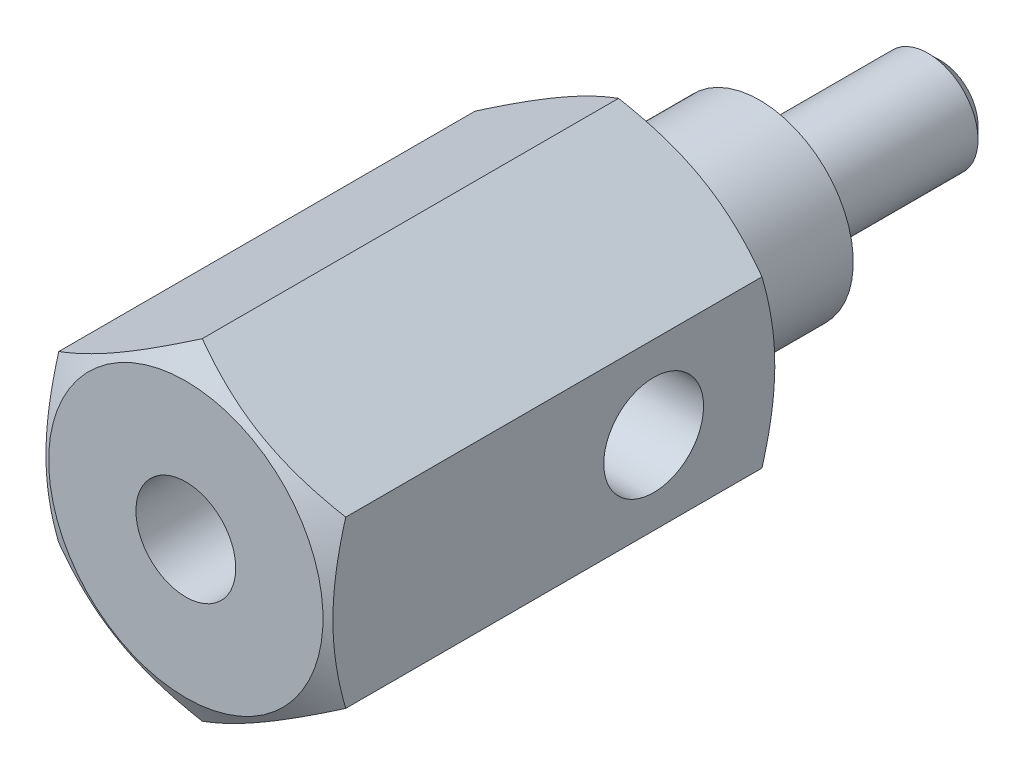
ISO-10303-21;
HEADER;
FILE_DESCRIPTION(('STEP AP214'),'2;1');
FILE_NAME('part.step','',(''),(''),'','','');
FILE_SCHEMA(('AUTOMOTIVE_DESIGN { 1 0 10303 214 1 1 1 1 }'));
ENDSEC;
DATA;
#1=APPLICATION_CONTEXT('core data for automotive mechanical design processes');
#2=APPLICATION_PROTOCOL_DEFINITION('international standard','automotive_design',2000,#1);
#3=PRODUCT_CONTEXT('',#1,'mechanical');
#4=PRODUCT('Part','Part','',(#3));
#5=PRODUCT_RELATED_PRODUCT_CATEGORY('part','',(#4));
#6=PRODUCT_DEFINITION_FORMATION('','',#4);
#7=PRODUCT_DEFINITION_CONTEXT('part definition',#1,'design');
#8=PRODUCT_DEFINITION('design','',#6,#7);
#9=PRODUCT_DEFINITION_SHAPE('','',#8);
#10=(LENGTH_UNIT() NAMED_UNIT(*) SI_UNIT(.MILLI.,.METRE.));
#11=(NAMED_UNIT(*) PLANE_ANGLE_UNIT() SI_UNIT($,.RADIAN.));
#12=(NAMED_UNIT(*) SI_UNIT($,.STERADIAN.) SOLID_ANGLE_UNIT());
#13=UNCERTAINTY_MEASURE_WITH_UNIT(LENGTH_MEASURE(1.E-05),#10,'distance_accuracy_value','');
#14=(GEOMETRIC_REPRESENTATION_CONTEXT(3) GLOBAL_UNCERTAINTY_ASSIGNED_CONTEXT((#13)) GLOBAL_UNIT_ASSIGNED_CONTEXT((#10,
#11,#12)) REPRESENTATION_CONTEXT('',''));
#15=CARTESIAN_POINT('',(0.,0.,0.));
#16=DIRECTION('',(0.,0.,1.));
#17=DIRECTION('',(1.,0.,0.));
#18=AXIS2_PLACEMENT_3D('',#15,#16,#17);
#19=CARTESIAN_POINT('',(13.5,0.,18.0000000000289));
#20=DIRECTION('',(0.,0.,-1.));
#21=DIRECTION('',(0.,1.,0.));
#22=AXIS2_PLACEMENT_3D('',#19,#20,#21);
#23=PLANE('',#22);
#24=CARTESIAN_POINT('',(0.,0.,18.0000000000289));
#25=DIRECTION('',(0.,0.,1.));
#26=DIRECTION('',(0.,-1.,0.));
#27=AXIS2_PLACEMENT_3D('',#24,#25,#26);
#28=CIRCLE('',#27,13.5);
#29=CARTESIAN_POINT('',(0.,-13.5,18.0000000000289));
#30=VERTEX_POINT('',#29);
#31=EDGE_CURVE('E163',#30,#30,#28,.T.);
#32=ORIENTED_EDGE('',*,*,#31,.F.);
#33=EDGE_LOOP('',(#32));
#34=FACE_BOUND('',#33,.T.);
#35=CARTESIAN_POINT('',(0.,0.,18.0000000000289));
#36=DIRECTION('',(0.,0.,-1.));
#37=DIRECTION('',(-1.,0.,0.));
#38=AXIS2_PLACEMENT_3D('',#35,#36,#37);
#39=CIRCLE('',#38,15.);
#40=CARTESIAN_POINT('',(-15.,0.,18.0000000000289));
#41=VERTEX_POINT('',#40);
#42=EDGE_CURVE('E24',#41,#41,#39,.T.);
#43=ORIENTED_EDGE('',*,*,#42,.F.);
#44=EDGE_LOOP('',(#43));
#45=FACE_BOUND('',#44,.T.);
#46=ADVANCED_FACE('F20',(#34,#45),#23,.F.);
#47=CARTESIAN_POINT('',(0.,0.,19.1999999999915));
#48=DIRECTION('',(0.,0.,1.));
#49=DIRECTION('',(0.,-1.,0.));
#50=AXIS2_PLACEMENT_3D('',#47,#48,#49);
#51=TOROIDAL_SURFACE('',#50,14.3,0.800000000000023);
#52=CARTESIAN_POINT('',(0.,0.,19.9999999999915));
#53=DIRECTION('',(0.,0.,1.));
#54=DIRECTION('',(0.,-1.,0.));
#55=AXIS2_PLACEMENT_3D('',#52,#53,#54);
#56=CIRCLE('',#55,14.3);
#57=CARTESIAN_POINT('',(0.,-14.3,19.9999999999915));
#58=VERTEX_POINT('',#57);
#59=EDGE_CURVE('E164',#58,#58,#56,.T.);
#60=ORIENTED_EDGE('',*,*,#59,.F.);
#61=EDGE_LOOP('',(#60));
#62=FACE_BOUND('',#61,.T.);
#63=CARTESIAN_POINT('',(0.,0.,19.1999999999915));
#64=DIRECTION('',(0.,0.,1.));
#65=DIRECTION('',(0.,-1.,0.));
#66=AXIS2_PLACEMENT_3D('',#63,#64,#65);
#67=CIRCLE('',#66,13.5);
#68=CARTESIAN_POINT('',(0.,-13.5,19.1999999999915));
#69=VERTEX_POINT('',#68);
#70=EDGE_CURVE('E158',#69,#69,#67,.T.);
#71=ORIENTED_EDGE('',*,*,#70,.T.);
#72=EDGE_LOOP('',(#71));
#73=FACE_BOUND('',#72,.T.);
#74=ADVANCED_FACE('F354',(#62,#73),#51,.F.);
#75=CARTESIAN_POINT('',(14.3,0.,19.9999999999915));
#76=DIRECTION('',(0.,0.,1.));
#77=DIRECTION('',(0.,-1.,0.));
#78=AXIS2_PLACEMENT_3D('',#75,#76,#77);
#79=PLANE('',#78);
#80=CARTESIAN_POINT('',(0.,0.,19.9999999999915));
#81=DIRECTION('',(0.,0.,1.));
#82=DIRECTION('',(0.,-1.,0.));
#83=AXIS2_PLACEMENT_3D('',#80,#81,#82);
#84=CIRCLE('',#83,21.9924229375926);
#85=CARTESIAN_POINT('',(0.,-21.9924229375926,19.9999999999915));
#86=VERTEX_POINT('',#85);
#87=EDGE_CURVE('E410',#86,#86,#84,.T.);
#88=ORIENTED_EDGE('',*,*,#87,.F.);
#89=EDGE_LOOP('',(#88));
#90=FACE_BOUND('',#89,.T.);
#91=ORIENTED_EDGE('',*,*,#59,.T.);
#92=EDGE_LOOP('',(#91));
#93=FACE_BOUND('',#92,.T.);
#94=ADVANCED_FACE('F361',(#90,#93),#79,.F.);
#95=CARTESIAN_POINT('',(0.,0.,19.9999999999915));
#96=DIRECTION('',(0.,0.,1.));
#97=DIRECTION('',(0.,-1.,0.));
#98=AXIS2_PLACEMENT_3D('',#95,#96,#97);
#99=CONICAL_SURFACE('',#98,21.9924229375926,1.0471975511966);
#100=ORIENTED_EDGE('',*,*,#87,.T.);
#101=EDGE_LOOP('',(#100));
#102=FACE_BOUND('',#101,.T.);
#103=CARTESIAN_POINT('',(-23.0001999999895,-13.2789407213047,22.636068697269));
#104=CARTESIAN_POINT('',(-22.4946699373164,-13.5708086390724,22.4675708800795));
#105=CARTESIAN_POINT('',(-21.9871680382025,-13.86381499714,22.3067192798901));
#106=CARTESIAN_POINT('',(-20.968094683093,-14.4521772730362,22.0024338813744));
#107=CARTESIAN_POINT('',(-20.4565219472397,-14.7475339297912,21.8590058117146));
#108=CARTESIAN_POINT('',(-19.4283073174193,-15.3411739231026,21.5914926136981));
#109=CARTESIAN_POINT('',(-18.9116563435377,-15.6394625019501,21.467453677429));
#110=CARTESIAN_POINT('',(-17.8747863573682,-16.2380996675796,21.2413908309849));
#111=CARTESIAN_POINT('',(-17.354567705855,-16.5384480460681,21.1393647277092));
#112=CARTESIAN_POINT('',(-16.3238595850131,-17.133527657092,20.9616584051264));
#113=CARTESIAN_POINT('',(-15.8134465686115,-17.4282147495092,20.8853905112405));
#114=CARTESIAN_POINT('',(-14.7902817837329,-18.0189392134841,20.7575066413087));
#115=CARTESIAN_POINT('',(-14.2775299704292,-18.3149766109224,20.7058911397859));
#116=CARTESIAN_POINT('',(-13.2511650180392,-18.9075486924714,20.628615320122));
#117=CARTESIAN_POINT('',(-12.7375536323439,-19.2040823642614,20.602924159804));
#118=CARTESIAN_POINT('',(-11.7098568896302,-19.7974233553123,20.5780495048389));
#119=CARTESIAN_POINT('',(-11.1957715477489,-20.0942306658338,20.5788651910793));
#120=CARTESIAN_POINT('',(-10.2346805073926,-20.6491168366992,20.6051528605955));
#121=CARTESIAN_POINT('',(-9.78760635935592,-20.9072352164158,20.6274192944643));
#122=CARTESIAN_POINT('',(-8.89452539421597,-21.4228557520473,20.691576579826));
#123=CARTESIAN_POINT('',(-8.44851856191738,-21.6803579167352,20.7334671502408));
#124=CARTESIAN_POINT('',(-7.55773701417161,-22.1946508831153,20.8361467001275));
#125=CARTESIAN_POINT('',(-7.11296378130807,-22.4514408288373,20.8969527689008));
#126=CARTESIAN_POINT('',(-6.2255469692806,-22.9637911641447,21.0363871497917));
#127=CARTESIAN_POINT('',(-5.78290338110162,-23.2193515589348,21.1150153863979));
#128=CARTESIAN_POINT('',(-4.43913170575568,-23.995178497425,21.3796512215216));
#129=CARTESIAN_POINT('',(-3.54182151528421,-24.5132407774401,21.5920603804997));
#130=CARTESIAN_POINT('',(-2.20576568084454,-25.2846129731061,21.9536770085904));
#131=CARTESIAN_POINT('',(-1.7624481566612,-25.5405624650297,22.0812529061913));
#132=CARTESIAN_POINT('',(-0.878879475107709,-26.0506910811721,22.3493201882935));
#133=CARTESIAN_POINT('',(-0.438627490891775,-26.3048706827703,22.4898079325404));
#134=CARTESIAN_POINT('',(0.000200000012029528,-26.5582278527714,22.6360686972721));
#135=B_SPLINE_CURVE_WITH_KNOTS('',3,(#103,#104,#105,#106,#107,#108,#109,#110,#111,#112,#113,
#114,#115,#116,#117,#118,#119,#120,#121,#122,#123,#124,#125,#126,#127,#128,#129,#130,#131,#132,
#133,#134),.UNSPECIFIED.,.F.,.F.,(4,2,2,2,2,2,2,2,2,2,2,2,2,2,2,4),(0.,1.822752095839,
3.64610187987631,5.4737314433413,7.30117883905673,9.08355891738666,10.8659733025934,
12.6462646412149,14.4265009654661,15.9762768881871,17.5260306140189,19.0771885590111,
20.6283399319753,23.7989683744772,25.3815208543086,26.9636285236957),.UNSPECIFIED.);
#136=CARTESIAN_POINT('',(-22.9999999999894,-13.2790561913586,22.6360020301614));
#137=VERTEX_POINT('',#136);
#138=CARTESIAN_POINT('',(1.20320420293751E-11,-26.5581123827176,22.6360020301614));
#139=VERTEX_POINT('',#138);
#140=EDGE_CURVE('E80',#137,#139,#135,.T.);
#141=ORIENTED_EDGE('',*,*,#140,.F.);
#142=CARTESIAN_POINT('',(-22.999999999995,35.137391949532,31.5488801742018));
#143=CARTESIAN_POINT('',(-22.9999999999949,34.6328085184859,31.3051417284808));
#144=CARTESIAN_POINT('',(-22.9999999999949,34.1276124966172,31.0626675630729));
#145=CARTESIAN_POINT('',(-22.9999999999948,33.1158666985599,30.5805463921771));
#146=CARTESIAN_POINT('',(-22.9999999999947,32.6093169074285,30.3408994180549));
#147=CARTESIAN_POINT('',(-22.9999999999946,31.5946593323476,29.8646958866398));
#148=CARTESIAN_POINT('',(-22.9999999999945,31.0865512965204,29.6281398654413));
#149=CARTESIAN_POINT('',(-22.9999999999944,30.0687263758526,29.158520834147));
#150=CARTESIAN_POINT('',(-22.9999999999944,29.559009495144,28.9254578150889));
#151=CARTESIAN_POINT('',(-22.9999999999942,28.0213285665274,28.2294257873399));
#152=CARTESIAN_POINT('',(-22.9999999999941,26.990675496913,27.7723659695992));
#153=CARTESIAN_POINT('',(-22.9999999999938,24.920876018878,26.8779843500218));
#154=CARTESIAN_POINT('',(-22.9999999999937,23.8817300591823,26.4406615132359));
#155=CARTESIAN_POINT('',(-22.9999999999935,21.7807603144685,25.585984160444));
#156=CARTESIAN_POINT('',(-22.9999999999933,20.7188138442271,25.1689295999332));
#157=CARTESIAN_POINT('',(-22.9999999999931,18.5823596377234,24.3676843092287));
#158=CARTESIAN_POINT('',(-22.999999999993,17.5078505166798,23.9834972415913));
#159=CARTESIAN_POINT('',(-22.9999999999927,15.3468305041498,23.2583741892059));
#160=CARTESIAN_POINT('',(-22.9999999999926,14.2603509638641,22.9173455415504));
#161=CARTESIAN_POINT('',(-22.9999999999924,12.071844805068,22.2896504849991));
#162=CARTESIAN_POINT('',(-22.9999999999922,10.9698232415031,22.0029668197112));
#163=CARTESIAN_POINT('',(-22.999999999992,9.30491916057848,21.6242300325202));
#164=CARTESIAN_POINT('',(-22.999999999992,8.74783648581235,21.5065103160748));
#165=CARTESIAN_POINT('',(-22.9999999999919,7.6299798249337,21.290036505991));
#166=CARTESIAN_POINT('',(-22.9999999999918,7.06920592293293,21.1912819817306));
#167=CARTESIAN_POINT('',(-22.9999999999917,5.94434909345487,21.0144938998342));
#168=CARTESIAN_POINT('',(-22.9999999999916,5.3802659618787,20.9364616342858));
#169=CARTESIAN_POINT('',(-22.9999999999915,4.24944349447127,20.8026880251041));
#170=CARTESIAN_POINT('',(-22.9999999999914,3.68270415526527,20.7469467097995));
#171=CARTESIAN_POINT('',(-22.9999999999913,2.55094652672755,20.6592512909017));
#172=CARTESIAN_POINT('',(-22.9999999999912,1.98593968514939,20.6271504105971));
#173=CARTESIAN_POINT('',(-22.9999999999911,0.855076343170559,20.5869034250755));
#174=CARTESIAN_POINT('',(-22.999999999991,0.289219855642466,20.5787569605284));
#175=CARTESIAN_POINT('',(-22.9999999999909,-0.842172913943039,20.5866115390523));
#176=CARTESIAN_POINT('',(-22.9999999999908,-1.40770924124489,20.6026059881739));
#177=CARTESIAN_POINT('',(-22.9999999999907,-2.53761411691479,20.6583473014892));
#178=CARTESIAN_POINT('',(-22.9999999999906,-3.10198261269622,20.6980952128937));
#179=CARTESIAN_POINT('',(-22.9999999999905,-4.47201591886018,20.8225915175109));
#180=CARTESIAN_POINT('',(-22.9999999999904,-5.27660599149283,20.9193617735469));
#181=CARTESIAN_POINT('',(-22.9999999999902,-6.87947044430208,21.1557783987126));
#182=CARTESIAN_POINT('',(-22.9999999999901,-7.67774385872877,21.2954311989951));
#183=CARTESIAN_POINT('',(-22.9999999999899,-9.26839888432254,21.6128609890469));
#184=CARTESIAN_POINT('',(-22.9999999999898,-10.0607640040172,21.7907198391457));
#185=CARTESIAN_POINT('',(-22.9999999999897,-11.6373562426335,22.1790428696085));
#186=CARTESIAN_POINT('',(-22.9999999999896,-12.4215836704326,22.3895058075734));
#187=CARTESIAN_POINT('',(-22.9999999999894,-14.0002566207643,22.8432342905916));
#188=CARTESIAN_POINT('',(-22.9999999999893,-14.7945138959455,23.0871503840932));
#189=CARTESIAN_POINT('',(-22.9999999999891,-16.3752474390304,23.5990952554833));
#190=CARTESIAN_POINT('',(-22.999999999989,-17.1617230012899,23.8671261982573));
#191=CARTESIAN_POINT('',(-22.9999999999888,-18.7231078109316,24.4216446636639));
#192=CARTESIAN_POINT('',(-22.9999999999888,-19.4980573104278,24.7080192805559));
#193=CARTESIAN_POINT('',(-22.9999999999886,-20.6556047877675,25.1498944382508));
#194=CARTESIAN_POINT('',(-22.9999999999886,-21.0405800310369,25.29921352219));
#195=CARTESIAN_POINT('',(-22.9999999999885,-21.8090350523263,25.6016218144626));
#196=CARTESIAN_POINT('',(-22.9999999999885,-22.1925148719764,25.7547109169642));
#197=CARTESIAN_POINT('',(-22.9999999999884,-22.5753017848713,25.9095155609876));
#198=B_SPLINE_CURVE_WITH_KNOTS('',3,(#142,#143,#144,#145,#146,#147,#148,#149,#150,#151,#152,
#153,#154,#155,#156,#157,#158,#159,#160,#161,#162,#163,#164,#165,#166,#167,#168,#169,#170,#171,
#172,#173,#174,#175,#176,#177,#178,#179,#180,#181,#182,#183,#184,#185,#186,#187,#188,#189,#190,
#191,#192,#193,#194,#195,#196,#197),.UNSPECIFIED.,.F.,.F.,(4,2,2,2,2,2,2,2,2,2,2,2,2,2,2,2,2,2,
2,2,2,2,2,2,2,2,2,4),(0.,1.68110615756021,3.36223094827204,5.04364354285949,6.72505182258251,
10.1072380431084,13.489246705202,16.9115461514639,20.3342264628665,23.749428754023,
27.1635447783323,28.8714282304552,30.5792728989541,32.28722403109,33.9951773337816,
35.6924349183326,37.3896670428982,39.08643566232,40.7832790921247,43.213090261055,
45.6432660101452,48.0787015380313,50.514044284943,53.0061841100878,55.4985478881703,
57.976821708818,59.2155628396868,60.4542692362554),.UNSPECIFIED.);
#199=CARTESIAN_POINT('',(-22.9999999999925,13.2790561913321,22.6360020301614));
#200=VERTEX_POINT('',#199);
#201=EDGE_CURVE('E70',#200,#137,#198,.T.);
#202=ORIENTED_EDGE('',*,*,#201,.F.);
#203=CARTESIAN_POINT('',(0.000199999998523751,26.5582278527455,22.6360686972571));
#204=CARTESIAN_POINT('',(-0.505330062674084,26.266359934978,22.4675708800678));
#205=CARTESIAN_POINT('',(-1.01283196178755,25.9733535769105,22.3067192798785));
#206=CARTESIAN_POINT('',(-2.03190531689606,25.3849913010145,22.0024338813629));
#207=CARTESIAN_POINT('',(-2.54347805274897,25.0896346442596,21.8590058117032));
#208=CARTESIAN_POINT('',(-3.57169268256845,24.4959946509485,21.5914926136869));
#209=CARTESIAN_POINT('',(-4.08834365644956,24.1977060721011,21.4674536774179));
#210=CARTESIAN_POINT('',(-5.12521364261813,23.5990689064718,21.2413908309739));
#211=CARTESIAN_POINT('',(-5.64543229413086,23.2987205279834,21.1393647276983));
#212=CARTESIAN_POINT('',(-6.67614041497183,22.7036409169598,20.9616584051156));
#213=CARTESIAN_POINT('',(-7.18655343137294,22.4089538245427,20.8853905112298));
#214=CARTESIAN_POINT('',(-8.20971821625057,21.8182293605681,20.757506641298));
#215=CARTESIAN_POINT('',(-8.7224700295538,21.5221919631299,20.7058911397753));
#216=CARTESIAN_POINT('',(-9.74883498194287,20.9296198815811,20.6286153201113));
#217=CARTESIAN_POINT('',(-10.2624463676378,20.6330862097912,20.6029241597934));
#218=CARTESIAN_POINT('',(-11.2901431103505,20.0397452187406,20.5780495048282));
#219=CARTESIAN_POINT('',(-11.8042284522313,19.7429379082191,20.5788651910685));
#220=CARTESIAN_POINT('',(-12.7653194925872,19.1880517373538,20.6051528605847));
#221=CARTESIAN_POINT('',(-13.2123936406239,18.929933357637,20.6274192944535));
#222=CARTESIAN_POINT('',(-14.1054746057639,18.4143128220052,20.6915765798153));
#223=CARTESIAN_POINT('',(-14.5514814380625,18.1568106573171,20.7334671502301));
#224=CARTESIAN_POINT('',(-15.4422629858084,17.6425176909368,20.8361467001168));
#225=CARTESIAN_POINT('',(-15.8870362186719,17.3857277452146,20.8969527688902));
#226=CARTESIAN_POINT('',(-16.7744530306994,16.8733774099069,21.0363871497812));
#227=CARTESIAN_POINT('',(-17.2170966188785,16.6178170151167,21.1150153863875));
#228=CARTESIAN_POINT('',(-18.5608682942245,15.841990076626,21.3796512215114));
#229=CARTESIAN_POINT('',(-19.458178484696,15.3239277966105,21.5920603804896));
#230=CARTESIAN_POINT('',(-20.7942343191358,14.5525556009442,21.9536770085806));
#231=CARTESIAN_POINT('',(-21.2375518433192,14.2966061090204,22.0812529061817));
#232=CARTESIAN_POINT('',(-22.1211205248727,13.7864774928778,22.349320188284));
#233=CARTESIAN_POINT('',(-22.5613725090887,13.5322978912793,22.4898079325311));
#234=CARTESIAN_POINT('',(-23.0001999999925,13.2789407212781,22.6360686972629));
#235=B_SPLINE_CURVE_WITH_KNOTS('',3,(#203,#204,#205,#206,#207,#208,#209,#210,#211,#212,#213,
#214,#215,#216,#217,#218,#219,#220,#221,#222,#223,#224,#225,#226,#227,#228,#229,#230,#231,#232,
#233,#234),.UNSPECIFIED.,.F.,.F.,(4,2,2,2,2,2,2,2,2,2,2,2,2,2,2,4),(0.,1.82275209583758,
3.64610187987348,5.47373144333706,7.30117883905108,9.08355891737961,10.8659733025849,
12.6462646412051,14.4265009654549,15.9762768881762,17.5260306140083,19.0771885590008,
20.6283399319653,23.798968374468,25.3815208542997,26.9636285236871),.UNSPECIFIED.);
#236=CARTESIAN_POINT('',(-1.47624967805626E-12,26.5581123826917,22.6360020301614));
#237=VERTEX_POINT('',#236);
#238=EDGE_CURVE('E75',#237,#200,#235,.T.);
#239=ORIENTED_EDGE('',*,*,#238,.F.);
#240=CARTESIAN_POINT('',(23.0001999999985,13.2789407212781,22.6360686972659));
#241=CARTESIAN_POINT('',(22.4946699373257,13.5708086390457,22.4675708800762));
#242=CARTESIAN_POINT('',(21.9871680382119,13.8638149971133,22.3067192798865));
#243=CARTESIAN_POINT('',(20.9680946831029,14.4521772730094,22.0024338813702));
#244=CARTESIAN_POINT('',(20.4565219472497,14.7475339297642,21.8590058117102));
#245=CARTESIAN_POINT('',(19.4283073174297,15.3411739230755,21.5914926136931));
#246=CARTESIAN_POINT('',(18.9116563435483,15.6394625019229,21.4674536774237));
#247=CARTESIAN_POINT('',(17.8747863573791,16.2380996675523,21.241390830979));
#248=CARTESIAN_POINT('',(17.3545677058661,16.5384480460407,21.139364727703));
#249=CARTESIAN_POINT('',(16.3238595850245,17.1335276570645,20.9616584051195));
#250=CARTESIAN_POINT('',(15.8134465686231,17.4282147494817,20.8853905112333));
#251=CARTESIAN_POINT('',(14.7902817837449,18.0189392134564,20.7575066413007));
#252=CARTESIAN_POINT('',(14.2775299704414,18.3149766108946,20.7058911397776));
#253=CARTESIAN_POINT('',(13.2511650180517,18.9075486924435,20.6286153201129));
#254=CARTESIAN_POINT('',(12.7375536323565,19.2040823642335,20.6029241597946));
#255=CARTESIAN_POINT('',(11.7098568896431,19.7974233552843,20.5780495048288));
#256=CARTESIAN_POINT('',(11.1957715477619,20.0942306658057,20.5788651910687));
#257=CARTESIAN_POINT('',(10.2346805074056,20.6491168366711,20.6051528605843));
#258=CARTESIAN_POINT('',(9.78760635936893,20.9072352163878,20.6274192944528));
#259=CARTESIAN_POINT('',(8.89452539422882,21.4228557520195,20.6915765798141));
#260=CARTESIAN_POINT('',(8.44851856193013,21.6803579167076,20.7334671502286));
#261=CARTESIAN_POINT('',(7.55773701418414,22.1946508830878,20.8361467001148));
#262=CARTESIAN_POINT('',(7.1129637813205,22.4514408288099,20.8969527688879));
#263=CARTESIAN_POINT('',(6.22554696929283,22.9637911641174,21.0363871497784));
#264=CARTESIAN_POINT('',(5.78290338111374,23.2193515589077,21.1150153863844));
#265=CARTESIAN_POINT('',(4.43913170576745,23.9951784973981,21.3796512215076));
#266=CARTESIAN_POINT('',(3.54182151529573,24.5132407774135,21.5920603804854));
#267=CARTESIAN_POINT('',(2.2057656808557,25.2846129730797,21.9536770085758));
#268=CARTESIAN_POINT('',(1.76244815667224,25.5405624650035,22.0812529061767));
#269=CARTESIAN_POINT('',(0.878879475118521,26.050691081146,22.3493201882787));
#270=CARTESIAN_POINT('',(0.438627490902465,26.3048706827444,22.4898079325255));
#271=CARTESIAN_POINT('',(-0.000200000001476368,26.5582278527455,22.6360686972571));
#272=B_SPLINE_CURVE_WITH_KNOTS('',3,(#240,#241,#242,#243,#244,#245,#246,#247,#248,#249,#250,
#251,#252,#253,#254,#255,#256,#257,#258,#259,#260,#261,#262,#263,#264,#265,#266,#267,#268,#269,
#270,#271),.UNSPECIFIED.,.F.,.F.,(4,2,2,2,2,2,2,2,2,2,2,2,2,2,2,4),(0.,1.82275209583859,
3.6461018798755,5.47373144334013,7.30117883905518,9.08355891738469,10.865973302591,
12.6462646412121,14.4265009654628,15.9762768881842,17.5260306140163,19.0771885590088,
20.6283399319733,23.798968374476,25.3815208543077,26.9636285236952),.UNSPECIFIED.);
#273=CARTESIAN_POINT('',(22.9999999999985,13.279056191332,22.6360020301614));
#274=VERTEX_POINT('',#273);
#275=EDGE_CURVE('E193',#274,#237,#272,.T.);
#276=ORIENTED_EDGE('',*,*,#275,.F.);
#277=CARTESIAN_POINT('',(22.999999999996,35.1373919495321,31.5488801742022));
#278=CARTESIAN_POINT('',(22.999999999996,34.632808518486,31.3051417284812));
#279=CARTESIAN_POINT('',(22.9999999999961,34.1276124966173,31.0626675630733));
#280=CARTESIAN_POINT('',(22.9999999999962,33.1158666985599,30.5805463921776));
#281=CARTESIAN_POINT('',(22.9999999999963,32.6093169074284,30.3408994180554));
#282=CARTESIAN_POINT('',(22.9999999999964,31.5946593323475,29.8646958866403));
#283=CARTESIAN_POINT('',(22.9999999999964,31.0865512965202,29.6281398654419));
#284=CARTESIAN_POINT('',(22.9999999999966,30.0687263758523,29.1585208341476));
#285=CARTESIAN_POINT('',(22.9999999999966,29.5590094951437,28.9254578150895));
#286=CARTESIAN_POINT('',(22.9999999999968,28.021328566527,28.2294257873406));
#287=CARTESIAN_POINT('',(22.9999999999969,26.9906754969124,27.7723659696));
#288=CARTESIAN_POINT('',(22.9999999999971,24.9208760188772,26.8779843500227));
#289=CARTESIAN_POINT('',(22.9999999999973,23.8817300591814,26.4406615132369));
#290=CARTESIAN_POINT('',(22.9999999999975,21.7807603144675,25.5859841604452));
#291=CARTESIAN_POINT('',(22.9999999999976,20.718813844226,25.1689295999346));
#292=CARTESIAN_POINT('',(22.9999999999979,18.5823596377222,24.3676843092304));
#293=CARTESIAN_POINT('',(22.999999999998,17.5078505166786,23.9834972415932));
#294=CARTESIAN_POINT('',(22.9999999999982,15.3468305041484,23.2583741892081));
#295=CARTESIAN_POINT('',(22.9999999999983,14.2603509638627,22.9173455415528));
#296=CARTESIAN_POINT('',(22.9999999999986,12.0718448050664,22.2896504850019));
#297=CARTESIAN_POINT('',(22.9999999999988,10.9698232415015,22.0029668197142));
#298=CARTESIAN_POINT('',(22.999999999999,9.30491916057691,21.6242300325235));
#299=CARTESIAN_POINT('',(22.999999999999,8.74783648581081,21.5065103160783));
#300=CARTESIAN_POINT('',(22.9999999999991,7.62997982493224,21.2900365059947));
#301=CARTESIAN_POINT('',(22.9999999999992,7.06920592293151,21.1912819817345));
#302=CARTESIAN_POINT('',(22.9999999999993,5.94434909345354,21.0144938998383));
#303=CARTESIAN_POINT('',(22.9999999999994,5.38026596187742,20.93646163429));
#304=CARTESIAN_POINT('',(22.9999999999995,4.24944349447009,20.8026880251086));
#305=CARTESIAN_POINT('',(22.9999999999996,3.68270415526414,20.7469467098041));
#306=CARTESIAN_POINT('',(22.9999999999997,2.55094652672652,20.6592512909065));
#307=CARTESIAN_POINT('',(22.9999999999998,1.98593968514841,20.6271504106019));
#308=CARTESIAN_POINT('',(22.9999999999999,0.855076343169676,20.5869034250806));
#309=CARTESIAN_POINT('',(23.,0.289219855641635,20.5787569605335));
#310=CARTESIAN_POINT('',(23.0000000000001,-0.842172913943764,20.5866115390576));
#311=CARTESIAN_POINT('',(23.0000000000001,-1.40770924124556,20.6026059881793));
#312=CARTESIAN_POINT('',(23.0000000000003,-2.53761411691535,20.6583473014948));
#313=CARTESIAN_POINT('',(23.0000000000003,-3.10198261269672,20.6980952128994));
#314=CARTESIAN_POINT('',(23.0000000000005,-4.47201591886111,20.8225915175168));
#315=CARTESIAN_POINT('',(23.0000000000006,-5.27660599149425,20.9193617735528));
#316=CARTESIAN_POINT('',(23.0000000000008,-6.87947044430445,21.1557783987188));
#317=CARTESIAN_POINT('',(23.0000000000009,-7.67774385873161,21.2954311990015));
#318=CARTESIAN_POINT('',(23.000000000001,-9.26839888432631,21.6128609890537));
#319=CARTESIAN_POINT('',(23.0000000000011,-10.0607640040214,21.7907198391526));
#320=CARTESIAN_POINT('',(23.0000000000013,-11.6373562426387,22.1790428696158));
#321=CARTESIAN_POINT('',(23.0000000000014,-12.4215836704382,22.3895058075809));
#322=CARTESIAN_POINT('',(23.0000000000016,-14.0002566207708,22.8432342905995));
#323=CARTESIAN_POINT('',(23.0000000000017,-14.7945138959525,23.0871503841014));
#324=CARTESIAN_POINT('',(23.0000000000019,-16.3752474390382,23.5990952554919));
#325=CARTESIAN_POINT('',(23.0000000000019,-17.1617230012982,23.8671261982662));
#326=CARTESIAN_POINT('',(23.0000000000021,-18.7231078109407,24.4216446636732));
#327=CARTESIAN_POINT('',(23.0000000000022,-19.4980573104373,24.7080192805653));
#328=CARTESIAN_POINT('',(23.0000000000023,-20.6556047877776,25.1498944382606));
#329=CARTESIAN_POINT('',(23.0000000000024,-21.0405800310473,25.2992135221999));
#330=CARTESIAN_POINT('',(23.0000000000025,-21.8090350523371,25.6016218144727));
#331=CARTESIAN_POINT('',(23.0000000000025,-22.1925148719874,25.7547109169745));
#332=CARTESIAN_POINT('',(23.0000000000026,-22.5753017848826,25.909515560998));
#333=B_SPLINE_CURVE_WITH_KNOTS('',3,(#277,#278,#279,#280,#281,#282,#283,#284,#285,#286,#287,
#288,#289,#290,#291,#292,#293,#294,#295,#296,#297,#298,#299,#300,#301,#302,#303,#304,#305,#306,
#307,#308,#309,#310,#311,#312,#313,#314,#315,#316,#317,#318,#319,#320,#321,#322,#323,#324,#325,
#326,#327,#328,#329,#330,#331,#332),.UNSPECIFIED.,.F.,.F.,(4,2,2,2,2,2,2,2,2,2,2,2,2,2,2,2,2,2,
2,2,2,2,2,2,2,2,2,4),(0.,1.6811061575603,3.36223094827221,5.04364354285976,6.72505182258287,
10.1072380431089,13.4892467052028,16.9115461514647,20.3342264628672,23.7494287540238,
27.163544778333,28.8714282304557,30.5792728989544,32.2872240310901,33.9951773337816,
35.6924349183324,37.3896670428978,39.0864356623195,40.783279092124,43.2130902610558,
45.6432660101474,48.0787015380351,50.5140442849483,53.0061841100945,55.4985478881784,
57.9768217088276,59.2155628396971,60.4542692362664),.UNSPECIFIED.);
#334=CARTESIAN_POINT('',(23.0000000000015,-13.2790561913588,22.6360020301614));
#335=VERTEX_POINT('',#334);
#336=EDGE_CURVE('E96',#335,#274,#333,.F.);
#337=ORIENTED_EDGE('',*,*,#336,.F.);
#338=CARTESIAN_POINT('',(-0.000199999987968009,-26.5582278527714,22.6360686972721));
#339=CARTESIAN_POINT('',(0.505330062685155,-26.2663599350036,22.4675708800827));
#340=CARTESIAN_POINT('',(1.01283196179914,-25.9733535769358,22.3067192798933));
#341=CARTESIAN_POINT('',(2.03190531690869,-25.3849913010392,22.0024338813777));
#342=CARTESIAN_POINT('',(2.54347805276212,-25.089634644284,21.859005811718));
#343=CARTESIAN_POINT('',(3.57169268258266,-24.4959946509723,21.5914926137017));
#344=CARTESIAN_POINT('',(4.08834365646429,-24.1977060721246,21.4674536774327));
#345=CARTESIAN_POINT('',(5.12521364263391,-23.5990689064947,21.2413908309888));
#346=CARTESIAN_POINT('',(5.64543229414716,-23.298720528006,21.1393647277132));
#347=CARTESIAN_POINT('',(6.67614041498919,-22.7036409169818,20.9616584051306));
#348=CARTESIAN_POINT('',(7.18655343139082,-22.4089538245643,20.8853905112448));
#349=CARTESIAN_POINT('',(8.20971821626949,-21.8182293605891,20.7575066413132));
#350=CARTESIAN_POINT('',(8.72247002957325,-21.5221919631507,20.7058911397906));
#351=CARTESIAN_POINT('',(9.74883498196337,-20.9296198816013,20.6286153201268));
#352=CARTESIAN_POINT('',(10.2624463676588,-20.6330862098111,20.602924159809));
#353=CARTESIAN_POINT('',(11.2901431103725,-20.0397452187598,20.5780495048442));
#354=CARTESIAN_POINT('',(11.8042284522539,-19.7429379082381,20.5788651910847));
#355=CARTESIAN_POINT('',(12.7653194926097,-19.1880517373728,20.6051528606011));
#356=CARTESIAN_POINT('',(13.2123936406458,-18.9299333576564,20.6274192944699));
#357=CARTESIAN_POINT('',(14.1054746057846,-18.4143128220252,20.6915765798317));
#358=CARTESIAN_POINT('',(14.5514814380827,-18.1568106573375,20.7334671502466));
#359=CARTESIAN_POINT('',(15.4422629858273,-17.6425176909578,20.8361467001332));
#360=CARTESIAN_POINT('',(15.8870362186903,-17.385727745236,20.8969527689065));
#361=CARTESIAN_POINT('',(16.7744530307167,-16.873377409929,21.0363871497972));
#362=CARTESIAN_POINT('',(17.2170966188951,-16.6178170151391,21.1150153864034));
#363=CARTESIAN_POINT('',(18.5608682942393,-15.8419900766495,21.3796512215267));
#364=CARTESIAN_POINT('',(19.4581784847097,-15.3239277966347,21.5920603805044));
#365=CARTESIAN_POINT('',(20.7942343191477,-14.5525556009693,21.9536770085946));
#366=CARTESIAN_POINT('',(21.2375518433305,-14.2966061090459,22.0812529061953));
#367=CARTESIAN_POINT('',(22.1211205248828,-13.7864774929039,22.349320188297));
#368=CARTESIAN_POINT('',(22.5613725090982,-13.5322978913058,22.4898079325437));
#369=CARTESIAN_POINT('',(23.0002000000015,-13.2789407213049,22.6360686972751));
#370=B_SPLINE_CURVE_WITH_KNOTS('',3,(#338,#339,#340,#341,#342,#343,#344,#345,#346,#347,#348,
#349,#350,#351,#352,#353,#354,#355,#356,#357,#358,#359,#360,#361,#362,#363,#364,#365,#366,#367,
#368,#369),.UNSPECIFIED.,.F.,.F.,(4,2,2,2,2,2,2,2,2,2,2,2,2,2,2,4),(0.,1.82275209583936,
3.64610187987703,5.47373144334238,7.30117883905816,9.08355891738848,10.8659733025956,
12.6462646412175,14.4265009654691,15.9762768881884,17.5260306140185,19.0771885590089,
20.6283399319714,23.7989683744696,25.3815208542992,26.9636285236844),.UNSPECIFIED.);
#371=EDGE_CURVE('E90',#139,#335,#370,.T.);
#372=ORIENTED_EDGE('',*,*,#371,.F.);
#373=EDGE_LOOP('',(#141,#202,#239,#276,#337,#372));
#374=FACE_BOUND('',#373,.T.);
#375=ADVANCED_FACE('F88',(#102,#374),#99,.T.);
#376=CARTESIAN_POINT('',(0.,0.,92.0000000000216));
#377=DIRECTION('',(0.,0.,1.));
#378=DIRECTION('',(0.,-1.,0.));
#379=AXIS2_PLACEMENT_3D('',#376,#377,#378);
#380=CYLINDRICAL_SURFACE('',#379,13.5);
#381=ORIENTED_EDGE('',*,*,#70,.F.);
#382=EDGE_LOOP('',(#381));
#383=FACE_BOUND('',#382,.T.);
#384=ORIENTED_EDGE('',*,*,#31,.T.);
#385=EDGE_LOOP('',(#384));
#386=FACE_BOUND('',#385,.T.);
#387=ADVANCED_FACE('F367',(#383,#386),#380,.T.);
#388=CARTESIAN_POINT('',(-22.9999999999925,13.279056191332,-70.2661606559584));
#389=DIRECTION('',(-1.,-1.14045273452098E-13,0.));
#390=DIRECTION('',(1.14045273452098E-13,-1.,0.));
#391=AXIS2_PLACEMENT_3D('',#388,#389,#390);
#392=PLANE('',#391);
#393=CARTESIAN_POINT('',(-22.999999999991,-2.62003666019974E-12,40.0000000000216));
#394=DIRECTION('',(-1.,-1.14045273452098E-13,0.));
#395=DIRECTION('',(1.14045273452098E-13,-1.,0.));
#396=AXIS2_PLACEMENT_3D('',#393,#394,#395);
#397=CIRCLE('',#396,8.);
#398=CARTESIAN_POINT('',(-22.9999999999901,-8.00000000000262,40.0000000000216));
#399=VERTEX_POINT('',#398);
#400=EDGE_CURVE('E85',#399,#399,#397,.F.);
#401=ORIENTED_EDGE('',*,*,#400,.T.);
#402=EDGE_LOOP('',(#401));
#403=FACE_BOUND('',#402,.T.);
#404=ORIENTED_EDGE('',*,*,#201,.T.);
#405=DIRECTION('',(0.,0.,1.));
#406=VECTOR('',#405,1.);
#407=CARTESIAN_POINT('',(-22.9999999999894,-13.2790561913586,-70.2661606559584));
#408=LINE('',#407,#406);
#409=CARTESIAN_POINT('',(-22.9999999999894,-13.2790561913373,89.3639979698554));
#410=VERTEX_POINT('',#409);
#411=EDGE_CURVE('E41',#137,#410,#408,.T.);
#412=ORIENTED_EDGE('',*,*,#411,.T.);
#413=CARTESIAN_POINT('',(-22.999999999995,35.1373919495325,80.4511198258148));
#414=CARTESIAN_POINT('',(-22.9999999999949,34.6328085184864,80.6948582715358));
#415=CARTESIAN_POINT('',(-22.9999999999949,34.1276124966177,80.9373324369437));
#416=CARTESIAN_POINT('',(-22.9999999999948,33.1158666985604,81.4194536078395));
#417=CARTESIAN_POINT('',(-22.9999999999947,32.609316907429,81.6591005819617));
#418=CARTESIAN_POINT('',(-22.9999999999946,31.5946593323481,82.1353041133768));
#419=CARTESIAN_POINT('',(-22.9999999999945,31.0865512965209,82.3718601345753));
#420=CARTESIAN_POINT('',(-22.9999999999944,30.0687263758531,82.8414791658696));
#421=CARTESIAN_POINT('',(-22.9999999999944,29.5590094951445,83.0745421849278));
#422=CARTESIAN_POINT('',(-22.9999999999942,28.0213285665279,83.7705742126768));
#423=CARTESIAN_POINT('',(-22.9999999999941,26.9906754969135,84.2276340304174));
#424=CARTESIAN_POINT('',(-22.9999999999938,24.9208760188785,85.1220156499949));
#425=CARTESIAN_POINT('',(-22.9999999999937,23.8817300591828,85.5593384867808));
#426=CARTESIAN_POINT('',(-22.9999999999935,21.780760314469,86.4140158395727));
#427=CARTESIAN_POINT('',(-22.9999999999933,20.7188138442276,86.8310704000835));
#428=CARTESIAN_POINT('',(-22.9999999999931,18.5823596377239,87.632315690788));
#429=CARTESIAN_POINT('',(-22.999999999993,17.5078505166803,88.0165027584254));
#430=CARTESIAN_POINT('',(-22.9999999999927,15.3468305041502,88.7416258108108));
#431=CARTESIAN_POINT('',(-22.9999999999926,14.2603509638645,89.0826544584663));
#432=CARTESIAN_POINT('',(-22.9999999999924,12.0718448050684,89.7103495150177));
#433=CARTESIAN_POINT('',(-22.9999999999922,10.9698232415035,89.9970331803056));
#434=CARTESIAN_POINT('',(-22.999999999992,9.30491916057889,90.3757699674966));
#435=CARTESIAN_POINT('',(-22.999999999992,8.74783648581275,90.4934896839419));
#436=CARTESIAN_POINT('',(-22.9999999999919,7.62997982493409,90.7099634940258));
#437=CARTESIAN_POINT('',(-22.9999999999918,7.06920592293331,90.8087180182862));
#438=CARTESIAN_POINT('',(-22.9999999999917,5.94434909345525,90.9855061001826));
#439=CARTESIAN_POINT('',(-22.9999999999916,5.38026596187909,91.063538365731));
#440=CARTESIAN_POINT('',(-22.9999999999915,4.24944349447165,91.1973119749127));
#441=CARTESIAN_POINT('',(-22.9999999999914,3.68270415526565,91.2530532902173));
#442=CARTESIAN_POINT('',(-22.9999999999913,2.55094652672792,91.3407487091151));
#443=CARTESIAN_POINT('',(-22.9999999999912,1.98593968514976,91.3728495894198));
#444=CARTESIAN_POINT('',(-22.9999999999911,0.855076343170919,91.4130965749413));
#445=CARTESIAN_POINT('',(-22.999999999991,0.289219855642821,91.4212430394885));
#446=CARTESIAN_POINT('',(-22.9999999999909,-0.842172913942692,91.4133884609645));
#447=CARTESIAN_POINT('',(-22.9999999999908,-1.40770924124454,91.3973940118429));
#448=CARTESIAN_POINT('',(-22.9999999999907,-2.53761411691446,91.3416526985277));
#449=CARTESIAN_POINT('',(-22.9999999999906,-3.10198261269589,91.3019047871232));
#450=CARTESIAN_POINT('',(-22.9999999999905,-4.47201591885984,91.177408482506));
#451=CARTESIAN_POINT('',(-22.9999999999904,-5.27660599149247,91.0806382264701));
#452=CARTESIAN_POINT('',(-22.9999999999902,-6.87947044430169,90.8442216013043));
#453=CARTESIAN_POINT('',(-22.9999999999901,-7.67774385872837,90.7045688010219));
#454=CARTESIAN_POINT('',(-22.9999999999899,-9.26839888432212,90.38713901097));
#455=CARTESIAN_POINT('',(-22.9999999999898,-10.0607640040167,90.2092801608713));
#456=CARTESIAN_POINT('',(-22.9999999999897,-11.637356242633,89.8209571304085));
#457=CARTESIAN_POINT('',(-22.9999999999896,-12.4215836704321,89.6104941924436));
#458=CARTESIAN_POINT('',(-22.9999999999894,-14.0002566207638,89.1567657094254));
#459=CARTESIAN_POINT('',(-22.9999999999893,-14.794513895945,88.9128496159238));
#460=CARTESIAN_POINT('',(-22.9999999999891,-16.3752474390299,88.4009047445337));
#461=CARTESIAN_POINT('',(-22.999999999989,-17.1617230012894,88.1328738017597));
#462=CARTESIAN_POINT('',(-22.9999999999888,-18.7231078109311,87.5783553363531));
#463=CARTESIAN_POINT('',(-22.9999999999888,-19.4980573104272,87.2919807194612));
#464=CARTESIAN_POINT('',(-22.9999999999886,-20.6556047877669,86.8501055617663));
#465=CARTESIAN_POINT('',(-22.9999999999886,-21.0405800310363,86.7007864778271));
#466=CARTESIAN_POINT('',(-22.9999999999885,-21.8090350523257,86.3983781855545));
#467=CARTESIAN_POINT('',(-22.9999999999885,-22.1925148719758,86.2452890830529));
#468=CARTESIAN_POINT('',(-22.9999999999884,-22.5753017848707,86.0904844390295));
#469=B_SPLINE_CURVE_WITH_KNOTS('',3,(#413,#414,#415,#416,#417,#418,#419,#420,#421,#422,#423,
#424,#425,#426,#427,#428,#429,#430,#431,#432,#433,#434,#435,#436,#437,#438,#439,#440,#441,#442,
#443,#444,#445,#446,#447,#448,#449,#450,#451,#452,#453,#454,#455,#456,#457,#458,#459,#460,#461,
#462,#463,#464,#465,#466,#467,#468),.UNSPECIFIED.,.F.,.F.,(4,2,2,2,2,2,2,2,2,2,2,2,2,2,2,2,2,2,
2,2,2,2,2,2,2,2,2,4),(0.,1.68110615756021,3.36223094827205,5.04364354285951,6.72505182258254,
10.1072380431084,13.4892467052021,16.911546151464,20.3342264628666,23.7494287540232,
27.1635447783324,28.8714282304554,30.5792728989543,32.2872240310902,33.9951773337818,
35.6924349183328,37.3896670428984,39.0864356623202,40.7832790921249,43.2130902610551,
45.6432660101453,48.0787015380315,50.5140442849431,53.0061841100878,55.4985478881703,
57.976821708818,59.2155628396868,60.4542692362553),.UNSPECIFIED.);
#470=CARTESIAN_POINT('',(-22.9999999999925,13.279056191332,89.3639979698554));
#471=VERTEX_POINT('',#470);
#472=EDGE_CURVE('E299',#410,#471,#469,.F.);
#473=ORIENTED_EDGE('',*,*,#472,.T.);
#474=DIRECTION('',(0.,0.,1.));
#475=VECTOR('',#474,1.);
#476=CARTESIAN_POINT('',(-22.9999999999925,13.279056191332,-70.2661606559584));
#477=LINE('',#476,#475);
#478=EDGE_CURVE('E36',#200,#471,#477,.T.);
#479=ORIENTED_EDGE('',*,*,#478,.F.);
#480=EDGE_LOOP('',(#404,#412,#473,#479));
#481=FACE_BOUND('',#480,.T.);
#482=ADVANCED_FACE('F71',(#403,#481),#392,.T.);
#483=CARTESIAN_POINT('',(-1.47624967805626E-12,26.5581123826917,-70.2661606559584));
#484=DIRECTION('',(-0.500000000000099,0.866025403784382,0.));
#485=DIRECTION('',(-0.866025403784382,-0.500000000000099,0.));
#486=AXIS2_PLACEMENT_3D('',#483,#484,#485);
#487=PLANE('',#486);
#488=ORIENTED_EDGE('',*,*,#238,.T.);
#489=ORIENTED_EDGE('',*,*,#478,.T.);
#490=CARTESIAN_POINT('',(-23.0001999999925,13.2789407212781,89.363931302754));
#491=CARTESIAN_POINT('',(-22.4946699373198,13.5708086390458,89.5324291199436));
#492=CARTESIAN_POINT('',(-21.9871680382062,13.8638149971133,89.6932807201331));
#493=CARTESIAN_POINT('',(-20.9680946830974,14.4521772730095,89.9975661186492));
#494=CARTESIAN_POINT('',(-20.4565219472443,14.7475339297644,90.1409941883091));
#495=CARTESIAN_POINT('',(-19.4283073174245,15.3411739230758,90.4085073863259));
#496=CARTESIAN_POINT('',(-18.9116563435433,15.6394625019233,90.5325463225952));
#497=CARTESIAN_POINT('',(-17.8747863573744,16.2380996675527,90.7586091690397));
#498=CARTESIAN_POINT('',(-17.3545677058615,16.5384480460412,90.8606352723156));
#499=CARTESIAN_POINT('',(-16.3238595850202,17.133527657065,91.0383415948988));
#500=CARTESIAN_POINT('',(-15.813446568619,17.4282147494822,91.114609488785));
#501=CARTESIAN_POINT('',(-14.790281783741,18.018939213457,91.2424933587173));
#502=CARTESIAN_POINT('',(-14.2775299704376,18.3149766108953,91.2941088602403));
#503=CARTESIAN_POINT('',(-13.2511650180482,18.9075486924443,91.3713846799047));
#504=CARTESIAN_POINT('',(-12.7375536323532,19.2040823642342,91.3970758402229));
#505=CARTESIAN_POINT('',(-11.70985688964,19.7974233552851,91.4219504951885));
#506=CARTESIAN_POINT('',(-11.195771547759,20.0942306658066,91.4211348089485));
#507=CARTESIAN_POINT('',(-10.2346805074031,20.649116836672,91.3948471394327));
#508=CARTESIAN_POINT('',(-9.78760635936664,20.9072352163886,91.3725807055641));
#509=CARTESIAN_POINT('',(-8.89452539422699,21.4228557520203,91.3084234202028));
#510=CARTESIAN_POINT('',(-8.44851856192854,21.6803579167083,91.2665328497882));
#511=CARTESIAN_POINT('',(-7.55773701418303,22.1946508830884,91.1638532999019));
#512=CARTESIAN_POINT('',(-7.11296378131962,22.4514408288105,91.1030472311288));
#513=CARTESIAN_POINT('',(-6.22554696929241,22.963791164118,90.9636128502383));
#514=CARTESIAN_POINT('',(-5.78290338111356,23.2193515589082,90.8849846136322));
#515=CARTESIAN_POINT('',(-4.439131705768,23.9951784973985,90.620348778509));
#516=CARTESIAN_POINT('',(-3.54182151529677,24.5132407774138,90.4079396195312));
#517=CARTESIAN_POINT('',(-2.20576568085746,25.2846129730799,90.0463229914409));
#518=CARTESIAN_POINT('',(-1.76244815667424,25.5405624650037,89.91874709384));
#519=CARTESIAN_POINT('',(-0.87887947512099,26.0506910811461,89.6506798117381));
#520=CARTESIAN_POINT('',(-0.438627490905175,26.3048706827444,89.5101920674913));
#521=CARTESIAN_POINT('',(0.000199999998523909,26.5582278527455,89.3639313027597));
#522=B_SPLINE_CURVE_WITH_KNOTS('',3,(#490,#491,#492,#493,#494,#495,#496,#497,#498,#499,#500,
#501,#502,#503,#504,#505,#506,#507,#508,#509,#510,#511,#512,#513,#514,#515,#516,#517,#518,#519,
#520,#521),.UNSPECIFIED.,.F.,.F.,(4,2,2,2,2,2,2,2,2,2,2,2,2,2,2,4),(0.,1.82275209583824,
3.6461018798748,5.47373144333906,7.30117883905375,9.08355891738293,10.8659733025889,
12.6462646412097,14.4265009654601,15.9762768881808,17.5260306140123,19.0771885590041,
20.628339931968,23.7989683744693,25.3815208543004,26.9636285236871),.UNSPECIFIED.);
#523=CARTESIAN_POINT('',(-1.47624967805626E-12,26.5581123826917,89.3639979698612));
#524=VERTEX_POINT('',#523);
#525=EDGE_CURVE('E212',#471,#524,#522,.T.);
#526=ORIENTED_EDGE('',*,*,#525,.T.);
#527=DIRECTION('',(0.,0.,1.));
#528=VECTOR('',#527,1.);
#529=CARTESIAN_POINT('',(-1.47624967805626E-12,26.5581123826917,-70.2661606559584));
#530=LINE('',#529,#528);
#531=EDGE_CURVE('E285',#237,#524,#530,.T.);
#532=ORIENTED_EDGE('',*,*,#531,.F.);
#533=EDGE_LOOP('',(#488,#489,#526,#532));
#534=FACE_BOUND('',#533,.T.);
#535=ADVANCED_FACE('F200',(#534),#487,.T.);
#536=CARTESIAN_POINT('',(22.9999999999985,13.279056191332,-70.2661606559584));
#537=DIRECTION('',(0.499999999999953,0.866025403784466,0.));
#538=DIRECTION('',(-0.866025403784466,0.499999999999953,0.));
#539=AXIS2_PLACEMENT_3D('',#536,#537,#538);
#540=PLANE('',#539);
#541=ORIENTED_EDGE('',*,*,#275,.T.);
#542=ORIENTED_EDGE('',*,*,#531,.T.);
#543=CARTESIAN_POINT('',(-0.000200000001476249,26.5582278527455,89.3639313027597));
#544=CARTESIAN_POINT('',(0.505330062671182,26.2663599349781,89.532429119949));
#545=CARTESIAN_POINT('',(1.0128319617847,25.9733535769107,89.6932807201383));
#546=CARTESIAN_POINT('',(2.03190531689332,25.3849913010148,89.9975661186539));
#547=CARTESIAN_POINT('',(2.54347805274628,25.0896346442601,90.1409941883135));
#548=CARTESIAN_POINT('',(3.57169268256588,24.4959946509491,90.4085073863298));
#549=CARTESIAN_POINT('',(4.08834365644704,24.1977060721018,90.5325463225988));
#550=CARTESIAN_POINT('',(5.12521364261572,23.5990689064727,90.7586091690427));
#551=CARTESIAN_POINT('',(5.64543229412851,23.2987205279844,90.8606352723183));
#552=CARTESIAN_POINT('',(6.67614041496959,22.7036409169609,91.038341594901));
#553=CARTESIAN_POINT('',(7.18655343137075,22.4089538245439,91.1146094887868));
#554=CARTESIAN_POINT('',(8.20971821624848,21.8182293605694,91.2424933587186));
#555=CARTESIAN_POINT('',(8.72247002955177,21.5221919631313,91.2941088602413));
#556=CARTESIAN_POINT('',(9.74883498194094,20.9296198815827,91.3713846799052));
#557=CARTESIAN_POINT('',(10.2624463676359,20.6330862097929,91.3970758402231));
#558=CARTESIAN_POINT('',(11.2901431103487,20.0397452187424,91.4219504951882));
#559=CARTESIAN_POINT('',(11.8042284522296,19.7429379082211,91.4211348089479));
#560=CARTESIAN_POINT('',(12.7653194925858,19.1880517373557,91.3948471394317));
#561=CARTESIAN_POINT('',(13.2123936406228,18.9299333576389,91.3725807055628));
#562=CARTESIAN_POINT('',(14.1054746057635,18.4143128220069,91.3084234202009));
#563=CARTESIAN_POINT('',(14.5514814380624,18.1568106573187,91.2665328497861));
#564=CARTESIAN_POINT('',(15.4422629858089,17.6425176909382,91.1638532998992));
#565=CARTESIAN_POINT('',(15.8870362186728,17.3857277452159,91.1030472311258));
#566=CARTESIAN_POINT('',(16.774453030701,16.8733774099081,90.9636128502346));
#567=CARTESIAN_POINT('',(17.2170966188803,16.6178170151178,90.8849846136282));
#568=CARTESIAN_POINT('',(18.5608682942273,15.8419900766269,90.6203487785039));
#569=CARTESIAN_POINT('',(19.4581784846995,15.3239277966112,90.4079396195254));
#570=CARTESIAN_POINT('',(20.7942343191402,14.5525556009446,90.046322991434));
#571=CARTESIAN_POINT('',(21.2375518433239,14.2966061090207,89.9187470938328));
#572=CARTESIAN_POINT('',(22.1211205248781,13.7864774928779,89.6506798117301));
#573=CARTESIAN_POINT('',(22.5613725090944,13.5322978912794,89.5101920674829));
#574=CARTESIAN_POINT('',(23.0001999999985,13.2789407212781,89.363931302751));
#575=B_SPLINE_CURVE_WITH_KNOTS('',3,(#543,#544,#545,#546,#547,#548,#549,#550,#551,#552,#553,
#554,#555,#556,#557,#558,#559,#560,#561,#562,#563,#564,#565,#566,#567,#568,#569,#570,#571,#572,
#573,#574),.UNSPECIFIED.,.F.,.F.,(4,2,2,2,2,2,2,2,2,2,2,2,2,2,2,4),(0.,1.82275209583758,
3.64610187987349,5.47373144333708,7.30117883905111,9.08355891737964,10.8659733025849,
12.6462646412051,14.4265009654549,15.9762768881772,17.5260306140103,19.0771885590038,
20.6283399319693,23.798968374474,25.3815208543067,26.9636285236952),.UNSPECIFIED.);
#576=CARTESIAN_POINT('',(22.9999999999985,13.279056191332,89.3639979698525));
#577=VERTEX_POINT('',#576);
#578=EDGE_CURVE('E301',#524,#577,#575,.T.);
#579=ORIENTED_EDGE('',*,*,#578,.T.);
#580=DIRECTION('',(0.,0.,1.));
#581=VECTOR('',#580,1.);
#582=CARTESIAN_POINT('',(22.9999999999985,13.279056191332,-70.2661606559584));
#583=LINE('',#582,#581);
#584=EDGE_CURVE('E288',#274,#577,#583,.T.);
#585=ORIENTED_EDGE('',*,*,#584,.F.);
#586=EDGE_LOOP('',(#541,#542,#579,#585));
#587=FACE_BOUND('',#586,.T.);
#588=ADVANCED_FACE('F204',(#587),#540,.T.);
#589=CARTESIAN_POINT('',(23.0000000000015,-13.2790561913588,-70.2661606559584));
#590=DIRECTION('',(1.,1.13914637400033E-13,0.));
#591=DIRECTION('',(-1.13914637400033E-13,1.,0.));
#592=AXIS2_PLACEMENT_3D('',#589,#590,#591);
#593=PLANE('',#592);
#594=CARTESIAN_POINT('',(23.,2.62003666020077E-12,40.0000000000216));
#595=DIRECTION('',(1.,1.13914637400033E-13,0.));
#596=DIRECTION('',(-1.13914637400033E-13,1.,0.));
#597=AXIS2_PLACEMENT_3D('',#594,#595,#596);
#598=CIRCLE('',#597,8.);
#599=CARTESIAN_POINT('',(22.9999999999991,8.00000000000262,40.0000000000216));
#600=VERTEX_POINT('',#599);
#601=EDGE_CURVE('E275',#600,#600,#598,.T.);
#602=ORIENTED_EDGE('',*,*,#601,.F.);
#603=EDGE_LOOP('',(#602));
#604=FACE_BOUND('',#603,.T.);
#605=ORIENTED_EDGE('',*,*,#336,.T.);
#606=ORIENTED_EDGE('',*,*,#584,.T.);
#607=CARTESIAN_POINT('',(22.999999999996,35.1373919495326,80.4511198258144));
#608=CARTESIAN_POINT('',(22.999999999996,34.6328085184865,80.6948582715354));
#609=CARTESIAN_POINT('',(22.9999999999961,34.1276124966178,80.9373324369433));
#610=CARTESIAN_POINT('',(22.9999999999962,33.1158666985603,81.419453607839));
#611=CARTESIAN_POINT('',(22.9999999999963,32.6093169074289,81.6591005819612));
#612=CARTESIAN_POINT('',(22.9999999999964,31.594659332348,82.1353041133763));
#613=CARTESIAN_POINT('',(22.9999999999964,31.0865512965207,82.3718601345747));
#614=CARTESIAN_POINT('',(22.9999999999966,30.0687263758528,82.841479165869));
#615=CARTESIAN_POINT('',(22.9999999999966,29.5590094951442,83.0745421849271));
#616=CARTESIAN_POINT('',(22.9999999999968,28.0213285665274,83.770574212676));
#617=CARTESIAN_POINT('',(22.9999999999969,26.9906754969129,84.2276340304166));
#618=CARTESIAN_POINT('',(22.9999999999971,24.9208760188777,85.1220156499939));
#619=CARTESIAN_POINT('',(22.9999999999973,23.8817300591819,85.5593384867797));
#620=CARTESIAN_POINT('',(22.9999999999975,21.780760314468,86.4140158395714));
#621=CARTESIAN_POINT('',(22.9999999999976,20.7188138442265,86.8310704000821));
#622=CARTESIAN_POINT('',(22.9999999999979,18.5823596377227,87.6323156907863));
#623=CARTESIAN_POINT('',(22.999999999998,17.5078505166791,88.0165027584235));
#624=CARTESIAN_POINT('',(22.9999999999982,15.3468305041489,88.7416258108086));
#625=CARTESIAN_POINT('',(22.9999999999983,14.2603509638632,89.0826544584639));
#626=CARTESIAN_POINT('',(22.9999999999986,12.0718448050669,89.7103495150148));
#627=CARTESIAN_POINT('',(22.9999999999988,10.9698232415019,89.9970331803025));
#628=CARTESIAN_POINT('',(22.999999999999,9.30491916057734,90.3757699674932));
#629=CARTESIAN_POINT('',(22.999999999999,8.74783648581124,90.4934896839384));
#630=CARTESIAN_POINT('',(22.9999999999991,7.62997982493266,90.7099634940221));
#631=CARTESIAN_POINT('',(22.9999999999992,7.06920592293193,90.8087180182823));
#632=CARTESIAN_POINT('',(22.9999999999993,5.94434909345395,90.9855061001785));
#633=CARTESIAN_POINT('',(22.9999999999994,5.38026596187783,91.0635383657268));
#634=CARTESIAN_POINT('',(22.9999999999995,4.24944349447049,91.1973119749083));
#635=CARTESIAN_POINT('',(22.9999999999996,3.68270415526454,91.2530532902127));
#636=CARTESIAN_POINT('',(22.9999999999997,2.5509465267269,91.3407487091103));
#637=CARTESIAN_POINT('',(22.9999999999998,1.98593968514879,91.3728495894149));
#638=CARTESIAN_POINT('',(22.9999999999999,0.855076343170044,91.4130965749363));
#639=CARTESIAN_POINT('',(23.,0.289219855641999,91.4212430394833));
#640=CARTESIAN_POINT('',(23.0000000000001,-0.84217291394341,91.4133884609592));
#641=CARTESIAN_POINT('',(23.0000000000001,-1.40770924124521,91.3973940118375));
#642=CARTESIAN_POINT('',(23.0000000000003,-2.53761411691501,91.3416526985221));
#643=CARTESIAN_POINT('',(23.0000000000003,-3.10198261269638,91.3019047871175));
#644=CARTESIAN_POINT('',(23.0000000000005,-4.47201591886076,91.1774084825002));
#645=CARTESIAN_POINT('',(23.0000000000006,-5.27660599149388,91.0806382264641));
#646=CARTESIAN_POINT('',(23.0000000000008,-6.87947044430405,90.8442216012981));
#647=CARTESIAN_POINT('',(23.0000000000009,-7.6777438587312,90.7045688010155));
#648=CARTESIAN_POINT('',(23.000000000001,-9.26839888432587,90.3871390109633));
#649=CARTESIAN_POINT('',(23.0000000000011,-10.0607640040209,90.2092801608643));
#650=CARTESIAN_POINT('',(23.0000000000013,-11.6373562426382,89.8209571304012));
#651=CARTESIAN_POINT('',(23.0000000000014,-12.4215836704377,89.6104941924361));
#652=CARTESIAN_POINT('',(23.0000000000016,-14.0002566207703,89.1567657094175));
#653=CARTESIAN_POINT('',(23.0000000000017,-14.7945138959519,88.9128496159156));
#654=CARTESIAN_POINT('',(23.0000000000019,-16.3752474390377,88.4009047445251));
#655=CARTESIAN_POINT('',(23.0000000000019,-17.1617230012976,88.1328738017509));
#656=CARTESIAN_POINT('',(23.0000000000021,-18.7231078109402,87.5783553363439));
#657=CARTESIAN_POINT('',(23.0000000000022,-19.4980573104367,87.2919807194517));
#658=CARTESIAN_POINT('',(23.0000000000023,-20.655604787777,86.8501055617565));
#659=CARTESIAN_POINT('',(23.0000000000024,-21.0405800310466,86.7007864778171));
#660=CARTESIAN_POINT('',(23.0000000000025,-21.8090350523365,86.3983781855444));
#661=CARTESIAN_POINT('',(23.0000000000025,-22.1925148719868,86.2452890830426));
#662=CARTESIAN_POINT('',(23.0000000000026,-22.575301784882,86.0904844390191));
#663=B_SPLINE_CURVE_WITH_KNOTS('',3,(#607,#608,#609,#610,#611,#612,#613,#614,#615,#616,#617,
#618,#619,#620,#621,#622,#623,#624,#625,#626,#627,#628,#629,#630,#631,#632,#633,#634,#635,#636,
#637,#638,#639,#640,#641,#642,#643,#644,#645,#646,#647,#648,#649,#650,#651,#652,#653,#654,#655,
#656,#657,#658,#659,#660,#661,#662),.UNSPECIFIED.,.F.,.F.,(4,2,2,2,2,2,2,2,2,2,2,2,2,2,2,2,2,2,
2,2,2,2,2,2,2,2,2,4),(0.,1.6811061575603,3.36223094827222,5.04364354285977,6.72505182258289,
10.107238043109,13.4892467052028,16.9115461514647,20.3342264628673,23.7494287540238,
27.1635447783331,28.8714282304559,30.5792728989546,32.2872240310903,33.9951773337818,
35.6924349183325,37.389667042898,39.0864356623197,40.7832790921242,43.2130902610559,
45.6432660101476,48.0787015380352,50.5140442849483,53.0061841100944,55.4985478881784,
57.9768217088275,59.215562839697,60.4542692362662),.UNSPECIFIED.);
#664=CARTESIAN_POINT('',(23.0000000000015,-13.2790561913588,89.3639979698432));
#665=VERTEX_POINT('',#664);
#666=EDGE_CURVE('E322',#577,#665,#663,.T.);
#667=ORIENTED_EDGE('',*,*,#666,.T.);
#668=DIRECTION('',(0.,0.,1.));
#669=VECTOR('',#668,1.);
#670=CARTESIAN_POINT('',(23.0000000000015,-13.2790561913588,-70.2661606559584));
#671=LINE('',#670,#669);
#672=EDGE_CURVE('E291',#335,#665,#671,.T.);
#673=ORIENTED_EDGE('',*,*,#672,.F.);
#674=EDGE_LOOP('',(#605,#606,#667,#673));
#675=FACE_BOUND('',#674,.T.);
#676=ADVANCED_FACE('F337',(#604,#675),#593,.T.);
#677=CARTESIAN_POINT('',(1.20320420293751E-11,-26.5581123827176,-70.2661606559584));
#678=DIRECTION('',(0.500000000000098,-0.866025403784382,0.));
#679=DIRECTION('',(0.866025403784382,0.500000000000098,0.));
#680=AXIS2_PLACEMENT_3D('',#677,#678,#679);
#681=PLANE('',#680);
#682=ORIENTED_EDGE('',*,*,#371,.T.);
#683=ORIENTED_EDGE('',*,*,#672,.T.);
#684=CARTESIAN_POINT('',(23.0002000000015,-13.2789407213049,89.3639313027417));
#685=CARTESIAN_POINT('',(22.4946699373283,-13.5708086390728,89.5324291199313));
#686=CARTESIAN_POINT('',(21.9871680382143,-13.8638149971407,89.6932807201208));
#687=CARTESIAN_POINT('',(20.9680946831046,-14.4521772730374,89.9975661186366));
#688=CARTESIAN_POINT('',(20.4565219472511,-14.7475339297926,90.1409941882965));
#689=CARTESIAN_POINT('',(19.4283073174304,-15.3411739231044,90.408507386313));
#690=CARTESIAN_POINT('',(18.9116563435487,-15.6394625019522,90.5325463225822));
#691=CARTESIAN_POINT('',(17.8747863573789,-16.2380996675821,90.7586091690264));
#692=CARTESIAN_POINT('',(17.3545677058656,-16.5384480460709,90.8606352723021));
#693=CARTESIAN_POINT('',(16.3238595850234,-17.1335276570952,91.038341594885));
#694=CARTESIAN_POINT('',(15.8134465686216,-17.4282147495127,91.1146094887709));
#695=CARTESIAN_POINT('',(14.7902817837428,-18.018939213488,91.2424933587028));
#696=CARTESIAN_POINT('',(14.277529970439,-18.3149766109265,91.2941088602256));
#697=CARTESIAN_POINT('',(13.2511650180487,-18.907548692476,91.3713846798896));
#698=CARTESIAN_POINT('',(12.7375536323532,-19.2040823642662,91.3970758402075));
#699=CARTESIAN_POINT('',(11.7098568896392,-19.7974233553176,91.4219504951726));
#700=CARTESIAN_POINT('',(11.1957715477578,-20.0942306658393,91.4211348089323));
#701=CARTESIAN_POINT('',(10.2346805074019,-20.6491168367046,91.3948471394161));
#702=CARTESIAN_POINT('',(9.78760635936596,-20.907235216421,91.3725807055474));
#703=CARTESIAN_POINT('',(8.89452539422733,-21.4228557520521,91.3084234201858));
#704=CARTESIAN_POINT('',(8.44851856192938,-21.6803579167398,91.266532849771));
#705=CARTESIAN_POINT('',(7.55773701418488,-22.1946508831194,91.1638532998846));
#706=CARTESIAN_POINT('',(7.11296378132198,-22.4514408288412,91.1030472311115));
#707=CARTESIAN_POINT('',(6.22554696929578,-22.963791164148,90.963612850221));
#708=CARTESIAN_POINT('',(5.78290338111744,-23.2193515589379,90.8849846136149));
#709=CARTESIAN_POINT('',(4.43913170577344,-23.9951784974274,90.620348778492));
#710=CARTESIAN_POINT('',(3.54182151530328,-24.5132407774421,90.4079396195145));
#711=CARTESIAN_POINT('',(2.20576568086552,-25.2846129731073,90.0463229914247));
#712=CARTESIAN_POINT('',(1.76244815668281,-25.5405624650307,89.9187470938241));
#713=CARTESIAN_POINT('',(0.878879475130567,-26.0506910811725,89.6506798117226));
#714=CARTESIAN_POINT('',(0.438627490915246,-26.3048706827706,89.5101920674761));
#715=CARTESIAN_POINT('',(-0.000199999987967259,-26.5582278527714,89.3639313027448));
#716=B_SPLINE_CURVE_WITH_KNOTS('',3,(#684,#685,#686,#687,#688,#689,#690,#691,#692,#693,#694,
#695,#696,#697,#698,#699,#700,#701,#702,#703,#704,#705,#706,#707,#708,#709,#710,#711,#712,#713,
#714,#715),.UNSPECIFIED.,.F.,.F.,(4,2,2,2,2,2,2,2,2,2,2,2,2,2,2,4),(0.,1.8227520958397,
3.64610187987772,5.47373144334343,7.30117883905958,9.08355891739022,10.8659733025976,
12.6462646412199,14.4265009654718,15.9762768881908,17.5260306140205,19.0771885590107,
20.6283399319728,23.7989683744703,25.3815208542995,26.9636285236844),.UNSPECIFIED.);
#717=CARTESIAN_POINT('',(1.20320420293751E-11,-26.5581123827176,89.3639979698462));
#718=VERTEX_POINT('',#717);
#719=EDGE_CURVE('E29',#665,#718,#716,.T.);
#720=ORIENTED_EDGE('',*,*,#719,.T.);
#721=DIRECTION('',(0.,0.,1.));
#722=VECTOR('',#721,1.);
#723=CARTESIAN_POINT('',(1.20320420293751E-11,-26.5581123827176,-70.2661606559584));
#724=LINE('',#723,#722);
#725=EDGE_CURVE('E84',#139,#718,#724,.T.);
#726=ORIENTED_EDGE('',*,*,#725,.F.);
#727=EDGE_LOOP('',(#682,#683,#720,#726));
#728=FACE_BOUND('',#727,.T.);
#729=ADVANCED_FACE('F122',(#728),#681,.T.);
#730=CARTESIAN_POINT('',(-22.9999999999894,-13.2790561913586,-70.2661606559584));
#731=DIRECTION('',(-0.499999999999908,-0.866025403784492,0.));
#732=DIRECTION('',(0.866025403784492,-0.499999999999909,0.));
#733=AXIS2_PLACEMENT_3D('',#730,#731,#732);
#734=PLANE('',#733);
#735=ORIENTED_EDGE('',*,*,#140,.T.);
#736=ORIENTED_EDGE('',*,*,#725,.T.);
#737=CARTESIAN_POINT('',(0.000200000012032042,-26.5582278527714,89.3639313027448));
#738=CARTESIAN_POINT('',(-0.505330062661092,-26.2663599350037,89.5324291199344));
#739=CARTESIAN_POINT('',(-1.01283196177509,-25.973353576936,89.6932807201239));
#740=CARTESIAN_POINT('',(-2.03190531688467,-25.3849913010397,89.99756611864));
#741=CARTESIAN_POINT('',(-2.54347805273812,-25.0896346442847,90.1409941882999));
#742=CARTESIAN_POINT('',(-3.57169268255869,-24.4959946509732,90.4085073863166));
#743=CARTESIAN_POINT('',(-4.08834365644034,-24.1977060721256,90.5325463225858));
#744=CARTESIAN_POINT('',(-5.12521364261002,-23.5990689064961,90.7586091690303));
#745=CARTESIAN_POINT('',(-5.64543229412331,-23.2987205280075,90.860635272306));
#746=CARTESIAN_POINT('',(-6.67614041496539,-22.7036409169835,91.0383415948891));
#747=CARTESIAN_POINT('',(-7.18655343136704,-22.4089538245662,91.1146094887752));
#748=CARTESIAN_POINT('',(-8.20971821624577,-21.8182293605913,91.2424933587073));
#749=CARTESIAN_POINT('',(-8.72247002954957,-21.522191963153,91.2941088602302));
#750=CARTESIAN_POINT('',(-9.74883498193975,-20.9296198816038,91.3713846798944));
#751=CARTESIAN_POINT('',(-10.2624463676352,-20.6330862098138,91.3970758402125));
#752=CARTESIAN_POINT('',(-11.2901431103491,-20.0397452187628,91.4219504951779));
#753=CARTESIAN_POINT('',(-11.8042284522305,-19.7429379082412,91.4211348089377));
#754=CARTESIAN_POINT('',(-12.7653194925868,-19.1880517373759,91.3948471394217));
#755=CARTESIAN_POINT('',(-13.2123936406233,-18.9299333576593,91.372580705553));
#756=CARTESIAN_POINT('',(-14.1054746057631,-18.4143128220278,91.3084234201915));
#757=CARTESIAN_POINT('',(-14.5514814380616,-18.15681065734,91.2665328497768));
#758=CARTESIAN_POINT('',(-15.4422629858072,-17.64251769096,91.1638532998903));
#759=CARTESIAN_POINT('',(-15.8870362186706,-17.385727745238,91.1030472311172));
#760=CARTESIAN_POINT('',(-16.7744530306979,-16.8733774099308,90.9636128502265));
#761=CARTESIAN_POINT('',(-17.2170966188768,-16.6178170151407,90.8849846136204));
#762=CARTESIAN_POINT('',(-18.5608682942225,-15.8419900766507,90.6203487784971));
#763=CARTESIAN_POINT('',(-19.4581784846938,-15.3239277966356,90.4079396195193));
#764=CARTESIAN_POINT('',(-20.7942343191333,-14.5525556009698,90.046322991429));
#765=CARTESIAN_POINT('',(-21.2375518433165,-14.2966061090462,89.9187470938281));
#766=CARTESIAN_POINT('',(-22.1211205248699,-13.786477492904,89.6506798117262));
#767=CARTESIAN_POINT('',(-22.5613725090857,-13.5322978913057,89.5101920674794));
#768=CARTESIAN_POINT('',(-23.0001999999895,-13.2789407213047,89.3639313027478));
#769=B_SPLINE_CURVE_WITH_KNOTS('',3,(#737,#738,#739,#740,#741,#742,#743,#744,#745,#746,#747,
#748,#749,#750,#751,#752,#753,#754,#755,#756,#757,#758,#759,#760,#761,#762,#763,#764,#765,#766,
#767,#768),.UNSPECIFIED.,.F.,.F.,(4,2,2,2,2,2,2,2,2,2,2,2,2,2,2,4),(0.,1.82275209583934,
3.646101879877,5.47373144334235,7.30117883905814,9.08355891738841,10.8659733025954,
12.6462646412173,14.4265009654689,15.9762768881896,17.526030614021,19.0771885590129,
20.6283399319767,23.7989683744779,25.3815208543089,26.9636285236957),.UNSPECIFIED.);
#770=EDGE_CURVE('E11',#718,#410,#769,.T.);
#771=ORIENTED_EDGE('',*,*,#770,.T.);
#772=ORIENTED_EDGE('',*,*,#411,.F.);
#773=EDGE_LOOP('',(#735,#736,#771,#772));
#774=FACE_BOUND('',#773,.T.);
#775=ADVANCED_FACE('F78',(#774),#734,.T.);
#776=CARTESIAN_POINT('',(0.,0.,92.0000000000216));
#777=DIRECTION('',(0.,0.,-1.));
#778=DIRECTION('',(0.,1.,0.));
#779=AXIS2_PLACEMENT_3D('',#776,#777,#778);
#780=PLANE('',#779);
#781=CARTESIAN_POINT('',(0.,0.,92.0000000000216));
#782=DIRECTION('',(0.,0.,1.));
#783=DIRECTION('',(0.,-1.,0.));
#784=AXIS2_PLACEMENT_3D('',#781,#782,#783);
#785=CIRCLE('',#784,8.);
#786=CARTESIAN_POINT('',(0.,-8.,92.0000000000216));
#787=VERTEX_POINT('',#786);
#788=EDGE_CURVE('E270',#787,#787,#785,.T.);
#789=ORIENTED_EDGE('',*,*,#788,.F.);
#790=EDGE_LOOP('',(#789));
#791=FACE_BOUND('',#790,.T.);
#792=CARTESIAN_POINT('',(0.,0.,92.0000000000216));
#793=DIRECTION('',(0.,0.,1.));
#794=DIRECTION('',(0.,-1.,0.));
#795=AXIS2_PLACEMENT_3D('',#792,#793,#794);
#796=CIRCLE('',#795,21.9924229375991);
#797=CARTESIAN_POINT('',(0.,-21.9924229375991,92.0000000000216));
#798=VERTEX_POINT('',#797);
#799=EDGE_CURVE('E409',#798,#798,#796,.T.);
#800=ORIENTED_EDGE('',*,*,#799,.T.);
#801=EDGE_LOOP('',(#800));
#802=FACE_BOUND('',#801,.T.);
#803=ADVANCED_FACE('F121',(#791,#802),#780,.F.);
#804=CARTESIAN_POINT('',(0.,0.,89.3639979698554));
#805=DIRECTION('',(0.,0.,-1.));
#806=DIRECTION('',(0.,1.,0.));
#807=AXIS2_PLACEMENT_3D('',#804,#805,#806);
#808=CONICAL_SURFACE('',#807,26.5581123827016,1.0471975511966);
#809=ORIENTED_EDGE('',*,*,#799,.F.);
#810=EDGE_LOOP('',(#809));
#811=FACE_BOUND('',#810,.T.);
#812=ORIENTED_EDGE('',*,*,#770,.F.);
#813=ORIENTED_EDGE('',*,*,#719,.F.);
#814=ORIENTED_EDGE('',*,*,#666,.F.);
#815=ORIENTED_EDGE('',*,*,#578,.F.);
#816=ORIENTED_EDGE('',*,*,#525,.F.);
#817=ORIENTED_EDGE('',*,*,#472,.F.);
#818=EDGE_LOOP('',(#812,#813,#814,#815,#816,#817));
#819=FACE_BOUND('',#818,.T.);
#820=ADVANCED_FACE('F296',(#811,#819),#808,.T.);
#821=CARTESIAN_POINT('',(-45.6274169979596,-5.19763066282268E-12,40.0000000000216));
#822=DIRECTION('',(1.,1.13914637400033E-13,0.));
#823=DIRECTION('',(-1.13914637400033E-13,1.,0.));
#824=AXIS2_PLACEMENT_3D('',#821,#822,#823);
#825=CYLINDRICAL_SURFACE('',#824,8.);
#826=ORIENTED_EDGE('',*,*,#601,.T.);
#827=EDGE_LOOP('',(#826));
#828=FACE_BOUND('',#827,.T.);
#829=ORIENTED_EDGE('',*,*,#400,.F.);
#830=EDGE_LOOP('',(#829));
#831=FACE_BOUND('',#830,.T.);
#832=ADVANCED_FACE('F206',(#828,#831),#825,.F.);
#833=CARTESIAN_POINT('',(0.,0.,63.0000000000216));
#834=DIRECTION('',(0.,0.,1.));
#835=DIRECTION('',(0.,-1.,0.));
#836=AXIS2_PLACEMENT_3D('',#833,#834,#835);
#837=CYLINDRICAL_SURFACE('',#836,8.);
#838=ORIENTED_EDGE('',*,*,#788,.T.);
#839=EDGE_LOOP('',(#838));
#840=FACE_BOUND('',#839,.T.);
#841=CARTESIAN_POINT('',(0.,0.,61.0000000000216));
#842=DIRECTION('',(0.,0.,1.));
#843=DIRECTION('',(1.,0.,0.));
#844=AXIS2_PLACEMENT_3D('',#841,#842,#843);
#845=CIRCLE('',#844,8.);
#846=CARTESIAN_POINT('',(8.,0.,61.0000000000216));
#847=VERTEX_POINT('',#846);
#848=EDGE_CURVE('E386',#847,#847,#845,.T.);
#849=ORIENTED_EDGE('',*,*,#848,.F.);
#850=EDGE_LOOP('',(#849));
#851=FACE_BOUND('',#850,.T.);
#852=ADVANCED_FACE('F391',(#840,#851),#837,.F.);
#853=CARTESIAN_POINT('',(0.,0.,104.852813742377));
#854=DIRECTION('',(0.,0.,-1.));
#855=DIRECTION('',(-1.,0.,0.));
#856=AXIS2_PLACEMENT_3D('',#853,#854,#855);
#857=CYLINDRICAL_SURFACE('',#856,15.);
#858=CARTESIAN_POINT('',(0.,0.,0.));
#859=DIRECTION('',(0.,0.,-1.));
#860=DIRECTION('',(-1.,0.,0.));
#861=AXIS2_PLACEMENT_3D('',#858,#859,#860);
#862=CIRCLE('',#861,15.);
#863=CARTESIAN_POINT('',(-15.,0.,0.));
#864=VERTEX_POINT('',#863);
#865=EDGE_CURVE('E276',#864,#864,#862,.T.);
#866=ORIENTED_EDGE('',*,*,#865,.F.);
#867=EDGE_LOOP('',(#866));
#868=FACE_BOUND('',#867,.T.);
#869=ORIENTED_EDGE('',*,*,#42,.T.);
#870=EDGE_LOOP('',(#869));
#871=FACE_BOUND('',#870,.T.);
#872=ADVANCED_FACE('F393',(#868,#871),#857,.T.);
#873=CARTESIAN_POINT('',(6.,0.,-29.));
#874=DIRECTION('',(0.,0.,1.));
#875=DIRECTION('',(0.,-1.,0.));
#876=AXIS2_PLACEMENT_3D('',#873,#874,#875);
#877=PLANE('',#876);
#878=CARTESIAN_POINT('',(0.,0.,-29.));
#879=DIRECTION('',(0.,0.,1.));
#880=DIRECTION('',(0.,-1.,0.));
#881=AXIS2_PLACEMENT_3D('',#878,#879,#880);
#882=CIRCLE('',#881,6.);
#883=CARTESIAN_POINT('',(0.,-6.,-29.));
#884=VERTEX_POINT('',#883);
#885=EDGE_CURVE('E262',#884,#884,#882,.T.);
#886=ORIENTED_EDGE('',*,*,#885,.F.);
#887=EDGE_LOOP('',(#886));
#888=FACE_BOUND('',#887,.T.);
#889=ADVANCED_FACE('F400',(#888),#877,.F.);
#890=CARTESIAN_POINT('',(0.,0.,-29.));
#891=DIRECTION('',(0.,0.,1.));
#892=DIRECTION('',(0.,-1.,0.));
#893=AXIS2_PLACEMENT_3D('',#890,#891,#892);
#894=CONICAL_SURFACE('',#893,6.,0.785398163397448);
#895=CARTESIAN_POINT('',(0.,0.,-27.));
#896=DIRECTION('',(0.,0.,1.));
#897=DIRECTION('',(0.,-1.,0.));
#898=AXIS2_PLACEMENT_3D('',#895,#896,#897);
#899=CIRCLE('',#898,8.);
#900=CARTESIAN_POINT('',(0.,-8.,-27.));
#901=VERTEX_POINT('',#900);
#902=EDGE_CURVE('E258',#901,#901,#899,.T.);
#903=ORIENTED_EDGE('',*,*,#902,.F.);
#904=EDGE_LOOP('',(#903));
#905=FACE_BOUND('',#904,.T.);
#906=ORIENTED_EDGE('',*,*,#885,.T.);
#907=EDGE_LOOP('',(#906));
#908=FACE_BOUND('',#907,.T.);
#909=ADVANCED_FACE('F423',(#905,#908),#894,.T.);
#910=CARTESIAN_POINT('',(0.,0.,92.0000000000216));
#911=DIRECTION('',(0.,0.,1.));
#912=DIRECTION('',(0.,-1.,0.));
#913=AXIS2_PLACEMENT_3D('',#910,#911,#912);
#914=CYLINDRICAL_SURFACE('',#913,8.);
#915=CARTESIAN_POINT('',(0.,0.,-3.99999999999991));
#916=DIRECTION('',(0.,0.,1.));
#917=DIRECTION('',(0.,-1.,0.));
#918=AXIS2_PLACEMENT_3D('',#915,#916,#917);
#919=CIRCLE('',#918,8.);
#920=CARTESIAN_POINT('',(0.,-8.,-3.99999999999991));
#921=VERTEX_POINT('',#920);
#922=EDGE_CURVE('E253',#921,#921,#919,.T.);
#923=ORIENTED_EDGE('',*,*,#922,.F.);
#924=EDGE_LOOP('',(#923));
#925=FACE_BOUND('',#924,.T.);
#926=ORIENTED_EDGE('',*,*,#902,.T.);
#927=EDGE_LOOP('',(#926));
#928=FACE_BOUND('',#927,.T.);
#929=ADVANCED_FACE('F430',(#925,#928),#914,.T.);
#930=CARTESIAN_POINT('',(7.5000000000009,0.,-3.99999999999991));
#931=DIRECTION('',(0.,0.,-1.));
#932=DIRECTION('',(0.,1.,0.));
#933=AXIS2_PLACEMENT_3D('',#930,#931,#932);
#934=PLANE('',#933);
#935=CARTESIAN_POINT('',(0.,0.,-3.99999999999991));
#936=DIRECTION('',(0.,0.,1.));
#937=DIRECTION('',(0.,-1.,0.));
#938=AXIS2_PLACEMENT_3D('',#935,#936,#937);
#939=CIRCLE('',#938,7.5000000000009);
#940=CARTESIAN_POINT('',(0.,-7.5000000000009,-3.99999999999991));
#941=VERTEX_POINT('',#940);
#942=EDGE_CURVE('E250',#941,#941,#939,.T.);
#943=ORIENTED_EDGE('',*,*,#942,.F.);
#944=EDGE_LOOP('',(#943));
#945=FACE_BOUND('',#944,.T.);
#946=ORIENTED_EDGE('',*,*,#922,.T.);
#947=EDGE_LOOP('',(#946));
#948=FACE_BOUND('',#947,.T.);
#949=ADVANCED_FACE('F436',(#945,#948),#934,.F.);
#950=CARTESIAN_POINT('',(0.,0.,-2.9999999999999));
#951=DIRECTION('',(0.,0.,1.));
#952=DIRECTION('',(0.,-1.,0.));
#953=AXIS2_PLACEMENT_3D('',#950,#951,#952);
#954=TOROIDAL_SURFACE('',#953,7.5000000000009,1.);
#955=CARTESIAN_POINT('',(0.,0.,-2.9999999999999));
#956=DIRECTION('',(0.,0.,1.));
#957=DIRECTION('',(0.,-1.,0.));
#958=AXIS2_PLACEMENT_3D('',#955,#956,#957);
#959=CIRCLE('',#958,6.50000000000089);
#960=CARTESIAN_POINT('',(0.,-6.50000000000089,-2.9999999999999));
#961=VERTEX_POINT('',#960);
#962=EDGE_CURVE('E94',#961,#961,#959,.T.);
#963=ORIENTED_EDGE('',*,*,#962,.F.);
#964=EDGE_LOOP('',(#963));
#965=FACE_BOUND('',#964,.T.);
#966=ORIENTED_EDGE('',*,*,#942,.T.);
#967=EDGE_LOOP('',(#966));
#968=FACE_BOUND('',#967,.T.);
#969=ADVANCED_FACE('F440',(#965,#968),#954,.F.);
#970=CARTESIAN_POINT('',(0.,0.,92.0000000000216));
#971=DIRECTION('',(0.,0.,1.));
#972=DIRECTION('',(0.,-1.,0.));
#973=AXIS2_PLACEMENT_3D('',#970,#971,#972);
#974=CYLINDRICAL_SURFACE('',#973,6.50000000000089);
#975=CARTESIAN_POINT('',(0.,0.,-1.));
#976=DIRECTION('',(0.,0.,1.));
#977=DIRECTION('',(0.,-1.,0.));
#978=AXIS2_PLACEMENT_3D('',#975,#976,#977);
#979=CIRCLE('',#978,6.50000000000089);
#980=CARTESIAN_POINT('',(0.,-6.50000000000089,-1.));
#981=VERTEX_POINT('',#980);
#982=EDGE_CURVE('E91',#981,#981,#979,.T.);
#983=ORIENTED_EDGE('',*,*,#982,.F.);
#984=EDGE_LOOP('',(#983));
#985=FACE_BOUND('',#984,.T.);
#986=ORIENTED_EDGE('',*,*,#962,.T.);
#987=EDGE_LOOP('',(#986));
#988=FACE_BOUND('',#987,.T.);
#989=ADVANCED_FACE('F379',(#985,#988),#974,.T.);
#990=CARTESIAN_POINT('',(0.,0.,-1.));
#991=DIRECTION('',(0.,0.,1.));
#992=DIRECTION('',(0.,-1.,0.));
#993=AXIS2_PLACEMENT_3D('',#990,#991,#992);
#994=TOROIDAL_SURFACE('',#993,7.5000000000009,1.);
#995=CARTESIAN_POINT('',(0.,0.,0.));
#996=DIRECTION('',(0.,0.,1.));
#997=DIRECTION('',(0.,-1.,0.));
#998=AXIS2_PLACEMENT_3D('',#995,#996,#997);
#999=CIRCLE('',#998,7.5000000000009);
#1000=CARTESIAN_POINT('',(0.,-7.5000000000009,0.));
#1001=VERTEX_POINT('',#1000);
#1002=EDGE_CURVE('E170',#1001,#1001,#999,.T.);
#1003=ORIENTED_EDGE('',*,*,#1002,.F.);
#1004=EDGE_LOOP('',(#1003));
#1005=FACE_BOUND('',#1004,.T.);
#1006=ORIENTED_EDGE('',*,*,#982,.T.);
#1007=EDGE_LOOP('',(#1006));
#1008=FACE_BOUND('',#1007,.T.);
#1009=ADVANCED_FACE('F22',(#1005,#1008),#994,.F.);
#1010=CARTESIAN_POINT('',(7.5000000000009,0.,0.));
#1011=DIRECTION('',(0.,0.,1.));
#1012=DIRECTION('',(0.,-1.,0.));
#1013=AXIS2_PLACEMENT_3D('',#1010,#1011,#1012);
#1014=PLANE('',#1013);
#1015=ORIENTED_EDGE('',*,*,#1002,.T.);
#1016=EDGE_LOOP('',(#1015));
#1017=FACE_BOUND('',#1016,.T.);
#1018=ORIENTED_EDGE('',*,*,#865,.T.);
#1019=EDGE_LOOP('',(#1018));
#1020=FACE_BOUND('',#1019,.T.);
#1021=ADVANCED_FACE('F368',(#1017,#1020),#1014,.F.);
#1022=CARTESIAN_POINT('',(0.,0.,61.0000000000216));
#1023=DIRECTION('',(0.,0.,1.));
#1024=DIRECTION('',(1.,0.,0.));
#1025=AXIS2_PLACEMENT_3D('',#1022,#1023,#1024);
#1026=PLANE('',#1025);
#1027=ORIENTED_EDGE('',*,*,#848,.T.);
#1028=EDGE_LOOP('',(#1027));
#1029=FACE_BOUND('',#1028,.T.);
#1030=ADVANCED_FACE('F370',(#1029),#1026,.T.);
#1031=CLOSED_SHELL('',(#46,#74,#94,#375,#387,#482,#535,#588,#676,#729,#775,#803,#820,#832,#852,
#872,#889,#909,#929,#949,#969,#989,#1009,#1021,#1030));
#1032=MANIFOLD_SOLID_BREP('B1',#1031);
#1033=ADVANCED_BREP_SHAPE_REPRESENTATION('',(#18,#1032),#14);
#1034=SHAPE_DEFINITION_REPRESENTATION(#9,#1033);
ENDSEC;
END-ISO-10303-21;
